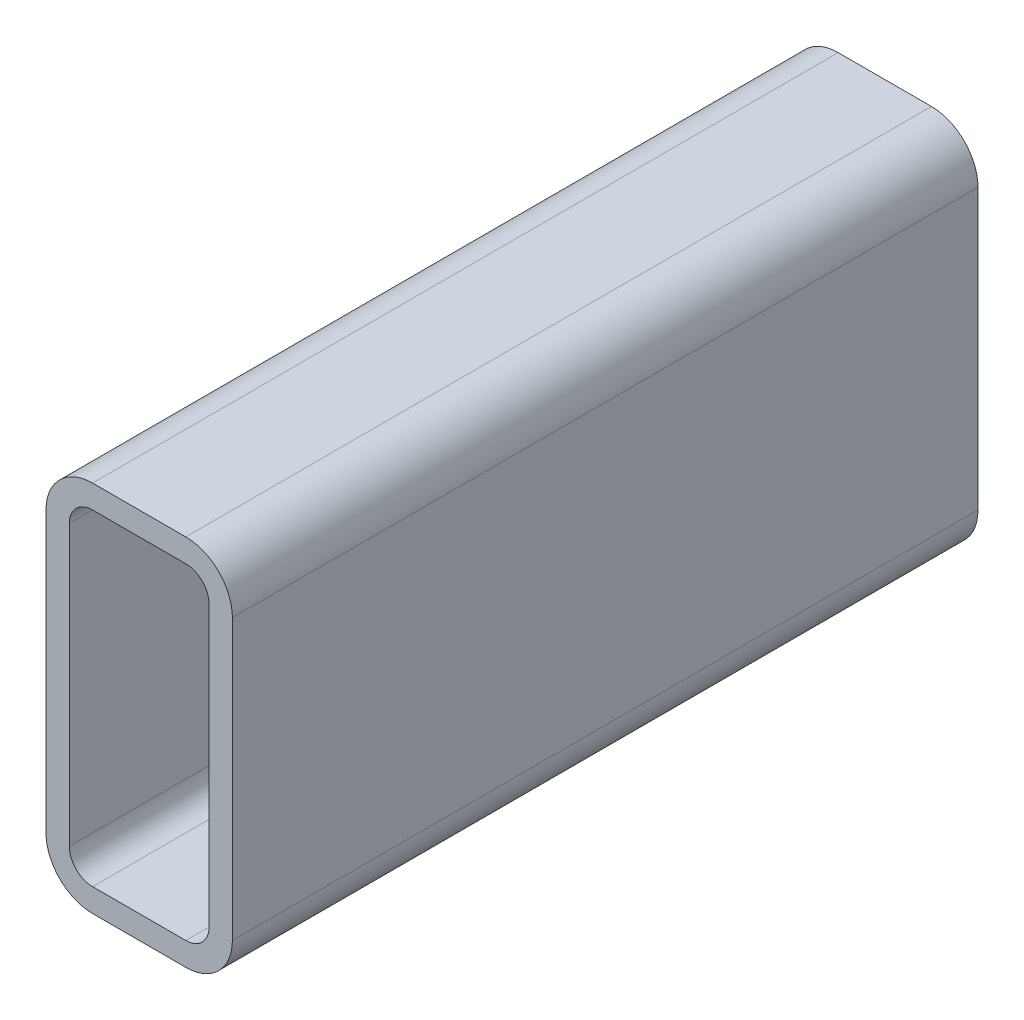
ISO-10303-21;
HEADER;
FILE_DESCRIPTION(('STEP AP214'),'2;1');
FILE_NAME('part.step','',(''),(''),'','','');
FILE_SCHEMA(('AUTOMOTIVE_DESIGN { 1 0 10303 214 1 1 1 1 }'));
ENDSEC;
DATA;
#1=APPLICATION_CONTEXT('core data for automotive mechanical design processes');
#2=APPLICATION_PROTOCOL_DEFINITION('international standard','automotive_design',2000,#1);
#3=PRODUCT_CONTEXT('',#1,'mechanical');
#4=PRODUCT('Part','Part','',(#3));
#5=PRODUCT_RELATED_PRODUCT_CATEGORY('part','',(#4));
#6=PRODUCT_DEFINITION_FORMATION('','',#4);
#7=PRODUCT_DEFINITION_CONTEXT('part definition',#1,'design');
#8=PRODUCT_DEFINITION('design','',#6,#7);
#9=PRODUCT_DEFINITION_SHAPE('','',#8);
#10=(LENGTH_UNIT() NAMED_UNIT(*) SI_UNIT(.MILLI.,.METRE.));
#11=(NAMED_UNIT(*) PLANE_ANGLE_UNIT() SI_UNIT($,.RADIAN.));
#12=(NAMED_UNIT(*) SI_UNIT($,.STERADIAN.) SOLID_ANGLE_UNIT());
#13=UNCERTAINTY_MEASURE_WITH_UNIT(LENGTH_MEASURE(1.E-05),#10,'distance_accuracy_value','');
#14=(GEOMETRIC_REPRESENTATION_CONTEXT(3) GLOBAL_UNCERTAINTY_ASSIGNED_CONTEXT((#13)) GLOBAL_UNIT_ASSIGNED_CONTEXT((#10,
#11,#12)) REPRESENTATION_CONTEXT('',''));
#15=CARTESIAN_POINT('',(0.,0.,0.));
#16=DIRECTION('',(0.,0.,1.));
#17=DIRECTION('',(1.,0.,0.));
#18=AXIS2_PLACEMENT_3D('',#15,#16,#17);
#19=CARTESIAN_POINT('',(21.5391160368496,135.361948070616,304.8));
#20=DIRECTION('',(0.,0.,1.));
#21=DIRECTION('',(1.,0.,0.));
#22=AXIS2_PLACEMENT_3D('',#19,#20,#21);
#23=PLANE('',#22);
#24=CARTESIAN_POINT('',(21.5391160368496,135.361948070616,304.8));
#25=DIRECTION('',(0.,0.,1.));
#26=DIRECTION('',(1.,0.,0.));
#27=AXIS2_PLACEMENT_3D('',#24,#25,#26);
#28=CIRCLE('',#27,19.05);
#29=CARTESIAN_POINT('',(21.5391160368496,154.411948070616,304.8));
#30=VERTEX_POINT('',#29);
#31=CARTESIAN_POINT('',(2.48911603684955,135.361948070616,304.8));
#32=VERTEX_POINT('',#31);
#33=EDGE_CURVE('E211',#30,#32,#28,.T.);
#34=ORIENTED_EDGE('',*,*,#33,.T.);
#35=DIRECTION('',(0.,-1.,0.));
#36=VECTOR('',#35,1.);
#37=CARTESIAN_POINT('',(2.48911603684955,21.0619480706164,304.8));
#38=LINE('',#37,#36);
#39=CARTESIAN_POINT('',(2.48911603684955,21.0619480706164,304.8));
#40=VERTEX_POINT('',#39);
#41=EDGE_CURVE('E214',#32,#40,#38,.T.);
#42=ORIENTED_EDGE('',*,*,#41,.T.);
#43=CARTESIAN_POINT('',(21.5391160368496,21.0619480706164,304.8));
#44=DIRECTION('',(0.,0.,1.));
#45=DIRECTION('',(1.,0.,0.));
#46=AXIS2_PLACEMENT_3D('',#43,#44,#45);
#47=CIRCLE('',#46,19.05);
#48=CARTESIAN_POINT('',(21.5391160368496,2.01194807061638,304.8));
#49=VERTEX_POINT('',#48);
#50=EDGE_CURVE('E217',#40,#49,#47,.T.);
#51=ORIENTED_EDGE('',*,*,#50,.T.);
#52=DIRECTION('',(1.,0.,0.));
#53=VECTOR('',#52,1.);
#54=CARTESIAN_POINT('',(59.6391160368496,2.01194807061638,304.8));
#55=LINE('',#54,#53);
#56=CARTESIAN_POINT('',(59.6391160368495,2.01194807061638,304.8));
#57=VERTEX_POINT('',#56);
#58=EDGE_CURVE('E219',#49,#57,#55,.T.);
#59=ORIENTED_EDGE('',*,*,#58,.T.);
#60=CARTESIAN_POINT('',(59.6391160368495,21.0619480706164,304.8));
#61=DIRECTION('',(0.,0.,1.));
#62=DIRECTION('',(1.,0.,0.));
#63=AXIS2_PLACEMENT_3D('',#60,#61,#62);
#64=CIRCLE('',#63,19.05);
#65=CARTESIAN_POINT('',(78.6891160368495,21.0619480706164,304.8));
#66=VERTEX_POINT('',#65);
#67=EDGE_CURVE('E221',#57,#66,#64,.T.);
#68=ORIENTED_EDGE('',*,*,#67,.T.);
#69=DIRECTION('',(0.,1.,0.));
#70=VECTOR('',#69,1.);
#71=CARTESIAN_POINT('',(78.6891160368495,135.361948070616,304.8));
#72=LINE('',#71,#70);
#73=CARTESIAN_POINT('',(78.6891160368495,135.361948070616,304.8));
#74=VERTEX_POINT('',#73);
#75=EDGE_CURVE('E223',#66,#74,#72,.T.);
#76=ORIENTED_EDGE('',*,*,#75,.T.);
#77=CARTESIAN_POINT('',(59.6391160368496,135.361948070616,304.8));
#78=DIRECTION('',(0.,0.,1.));
#79=DIRECTION('',(1.,0.,0.));
#80=AXIS2_PLACEMENT_3D('',#77,#78,#79);
#81=CIRCLE('',#80,19.05);
#82=CARTESIAN_POINT('',(59.6391160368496,154.411948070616,304.8));
#83=VERTEX_POINT('',#82);
#84=EDGE_CURVE('E225',#74,#83,#81,.T.);
#85=ORIENTED_EDGE('',*,*,#84,.T.);
#86=DIRECTION('',(-1.,0.,0.));
#87=VECTOR('',#86,1.);
#88=CARTESIAN_POINT('',(21.5391160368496,154.411948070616,304.8));
#89=LINE('',#88,#87);
#90=EDGE_CURVE('E227',#83,#30,#89,.T.);
#91=ORIENTED_EDGE('',*,*,#90,.T.);
#92=EDGE_LOOP('',(#34,#42,#51,#59,#68,#76,#85,#91));
#93=FACE_BOUND('',#92,.T.);
#94=DIRECTION('',(0.,-1.,0.));
#95=VECTOR('',#94,1.);
#96=CARTESIAN_POINT('',(12.0141160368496,21.0619480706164,304.8));
#97=LINE('',#96,#95);
#98=CARTESIAN_POINT('',(12.0141160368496,135.361948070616,304.8));
#99=VERTEX_POINT('',#98);
#100=CARTESIAN_POINT('',(12.0141160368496,21.0619480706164,304.8));
#101=VERTEX_POINT('',#100);
#102=EDGE_CURVE('E154',#99,#101,#97,.T.);
#103=ORIENTED_EDGE('',*,*,#102,.F.);
#104=CARTESIAN_POINT('',(21.5391160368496,135.361948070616,304.8));
#105=DIRECTION('',(0.,0.,1.));
#106=DIRECTION('',(1.,0.,0.));
#107=AXIS2_PLACEMENT_3D('',#104,#105,#106);
#108=CIRCLE('',#107,9.52499999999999);
#109=CARTESIAN_POINT('',(21.5391160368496,144.886948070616,304.8));
#110=VERTEX_POINT('',#109);
#111=EDGE_CURVE('E146',#110,#99,#108,.T.);
#112=ORIENTED_EDGE('',*,*,#111,.F.);
#113=DIRECTION('',(-1.,0.,0.));
#114=VECTOR('',#113,1.);
#115=CARTESIAN_POINT('',(21.5391160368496,144.886948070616,304.8));
#116=LINE('',#115,#114);
#117=CARTESIAN_POINT('',(59.6391160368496,144.886948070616,304.8));
#118=VERTEX_POINT('',#117);
#119=EDGE_CURVE('E179',#118,#110,#116,.T.);
#120=ORIENTED_EDGE('',*,*,#119,.F.);
#121=CARTESIAN_POINT('',(59.6391160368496,135.361948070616,304.8));
#122=DIRECTION('',(0.,0.,1.));
#123=DIRECTION('',(1.,0.,0.));
#124=AXIS2_PLACEMENT_3D('',#121,#122,#123);
#125=CIRCLE('',#124,9.52499999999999);
#126=CARTESIAN_POINT('',(69.1641160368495,135.361948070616,304.8));
#127=VERTEX_POINT('',#126);
#128=EDGE_CURVE('E177',#127,#118,#125,.T.);
#129=ORIENTED_EDGE('',*,*,#128,.F.);
#130=DIRECTION('',(0.,1.,0.));
#131=VECTOR('',#130,1.);
#132=CARTESIAN_POINT('',(69.1641160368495,135.361948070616,304.8));
#133=LINE('',#132,#131);
#134=CARTESIAN_POINT('',(69.1641160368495,21.0619480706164,304.8));
#135=VERTEX_POINT('',#134);
#136=EDGE_CURVE('E175',#135,#127,#133,.T.);
#137=ORIENTED_EDGE('',*,*,#136,.F.);
#138=CARTESIAN_POINT('',(59.6391160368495,21.0619480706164,304.8));
#139=DIRECTION('',(0.,0.,1.));
#140=DIRECTION('',(1.,0.,0.));
#141=AXIS2_PLACEMENT_3D('',#138,#139,#140);
#142=CIRCLE('',#141,9.525);
#143=CARTESIAN_POINT('',(59.6391160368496,11.5369480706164,304.8));
#144=VERTEX_POINT('',#143);
#145=EDGE_CURVE('E173',#144,#135,#142,.T.);
#146=ORIENTED_EDGE('',*,*,#145,.F.);
#147=DIRECTION('',(1.,0.,0.));
#148=VECTOR('',#147,1.);
#149=CARTESIAN_POINT('',(59.6391160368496,11.5369480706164,304.8));
#150=LINE('',#149,#148);
#151=CARTESIAN_POINT('',(21.5391160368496,11.5369480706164,304.8));
#152=VERTEX_POINT('',#151);
#153=EDGE_CURVE('E169',#152,#144,#150,.T.);
#154=ORIENTED_EDGE('',*,*,#153,.F.);
#155=CARTESIAN_POINT('',(21.5391160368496,21.0619480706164,304.8));
#156=DIRECTION('',(0.,0.,1.));
#157=DIRECTION('',(1.,0.,0.));
#158=AXIS2_PLACEMENT_3D('',#155,#156,#157);
#159=CIRCLE('',#158,9.525);
#160=EDGE_CURVE('E167',#101,#152,#159,.T.);
#161=ORIENTED_EDGE('',*,*,#160,.F.);
#162=EDGE_LOOP('',(#103,#112,#120,#129,#137,#146,#154,#161));
#163=FACE_BOUND('',#162,.T.);
#164=ADVANCED_FACE('F33',(#93,#163),#23,.T.);
#165=CARTESIAN_POINT('',(21.5391160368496,135.361948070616,0.));
#166=DIRECTION('',(0.,0.,1.));
#167=DIRECTION('',(1.,0.,0.));
#168=AXIS2_PLACEMENT_3D('',#165,#166,#167);
#169=PLANE('',#168);
#170=CARTESIAN_POINT('',(21.5391160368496,135.361948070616,0.));
#171=DIRECTION('',(0.,0.,1.));
#172=DIRECTION('',(1.,0.,0.));
#173=AXIS2_PLACEMENT_3D('',#170,#171,#172);
#174=CIRCLE('',#173,19.05);
#175=CARTESIAN_POINT('',(21.5391160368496,154.411948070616,0.));
#176=VERTEX_POINT('',#175);
#177=CARTESIAN_POINT('',(2.48911603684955,135.361948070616,0.));
#178=VERTEX_POINT('',#177);
#179=EDGE_CURVE('E162',#176,#178,#174,.T.);
#180=ORIENTED_EDGE('',*,*,#179,.F.);
#181=DIRECTION('',(-1.,0.,0.));
#182=VECTOR('',#181,1.);
#183=CARTESIAN_POINT('',(21.5391160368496,154.411948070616,0.));
#184=LINE('',#183,#182);
#185=CARTESIAN_POINT('',(59.6391160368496,154.411948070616,0.));
#186=VERTEX_POINT('',#185);
#187=EDGE_CURVE('E215',#186,#176,#184,.T.);
#188=ORIENTED_EDGE('',*,*,#187,.F.);
#189=CARTESIAN_POINT('',(59.6391160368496,135.361948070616,0.));
#190=DIRECTION('',(0.,0.,1.));
#191=DIRECTION('',(1.,0.,0.));
#192=AXIS2_PLACEMENT_3D('',#189,#190,#191);
#193=CIRCLE('',#192,19.05);
#194=CARTESIAN_POINT('',(78.6891160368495,135.361948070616,0.));
#195=VERTEX_POINT('',#194);
#196=EDGE_CURVE('E242',#195,#186,#193,.T.);
#197=ORIENTED_EDGE('',*,*,#196,.F.);
#198=DIRECTION('',(0.,1.,0.));
#199=VECTOR('',#198,1.);
#200=CARTESIAN_POINT('',(78.6891160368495,135.361948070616,0.));
#201=LINE('',#200,#199);
#202=CARTESIAN_POINT('',(78.6891160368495,21.0619480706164,0.));
#203=VERTEX_POINT('',#202);
#204=EDGE_CURVE('E240',#203,#195,#201,.T.);
#205=ORIENTED_EDGE('',*,*,#204,.F.);
#206=CARTESIAN_POINT('',(59.6391160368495,21.0619480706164,0.));
#207=DIRECTION('',(0.,0.,1.));
#208=DIRECTION('',(1.,0.,0.));
#209=AXIS2_PLACEMENT_3D('',#206,#207,#208);
#210=CIRCLE('',#209,19.05);
#211=CARTESIAN_POINT('',(59.6391160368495,2.01194807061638,0.));
#212=VERTEX_POINT('',#211);
#213=EDGE_CURVE('E238',#212,#203,#210,.T.);
#214=ORIENTED_EDGE('',*,*,#213,.F.);
#215=DIRECTION('',(1.,0.,0.));
#216=VECTOR('',#215,1.);
#217=CARTESIAN_POINT('',(59.6391160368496,2.01194807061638,0.));
#218=LINE('',#217,#216);
#219=CARTESIAN_POINT('',(21.5391160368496,2.01194807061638,0.));
#220=VERTEX_POINT('',#219);
#221=EDGE_CURVE('E236',#220,#212,#218,.T.);
#222=ORIENTED_EDGE('',*,*,#221,.F.);
#223=CARTESIAN_POINT('',(21.5391160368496,21.0619480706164,0.));
#224=DIRECTION('',(0.,0.,1.));
#225=DIRECTION('',(1.,0.,0.));
#226=AXIS2_PLACEMENT_3D('',#223,#224,#225);
#227=CIRCLE('',#226,19.05);
#228=CARTESIAN_POINT('',(2.48911603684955,21.0619480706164,0.));
#229=VERTEX_POINT('',#228);
#230=EDGE_CURVE('E234',#229,#220,#227,.T.);
#231=ORIENTED_EDGE('',*,*,#230,.F.);
#232=DIRECTION('',(0.,-1.,0.));
#233=VECTOR('',#232,1.);
#234=CARTESIAN_POINT('',(2.48911603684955,21.0619480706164,0.));
#235=LINE('',#234,#233);
#236=EDGE_CURVE('E232',#178,#229,#235,.T.);
#237=ORIENTED_EDGE('',*,*,#236,.F.);
#238=EDGE_LOOP('',(#180,#188,#197,#205,#214,#222,#231,#237));
#239=FACE_BOUND('',#238,.T.);
#240=CARTESIAN_POINT('',(21.5391160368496,135.361948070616,0.));
#241=DIRECTION('',(0.,0.,1.));
#242=DIRECTION('',(1.,0.,0.));
#243=AXIS2_PLACEMENT_3D('',#240,#241,#242);
#244=CIRCLE('',#243,9.52499999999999);
#245=CARTESIAN_POINT('',(21.5391160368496,144.886948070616,0.));
#246=VERTEX_POINT('',#245);
#247=CARTESIAN_POINT('',(12.0141160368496,135.361948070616,0.));
#248=VERTEX_POINT('',#247);
#249=EDGE_CURVE('E56',#246,#248,#244,.T.);
#250=ORIENTED_EDGE('',*,*,#249,.T.);
#251=DIRECTION('',(0.,-1.,0.));
#252=VECTOR('',#251,1.);
#253=CARTESIAN_POINT('',(12.0141160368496,21.0619480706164,0.));
#254=LINE('',#253,#252);
#255=CARTESIAN_POINT('',(12.0141160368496,21.0619480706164,0.));
#256=VERTEX_POINT('',#255);
#257=EDGE_CURVE('E161',#248,#256,#254,.T.);
#258=ORIENTED_EDGE('',*,*,#257,.T.);
#259=CARTESIAN_POINT('',(21.5391160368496,21.0619480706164,0.));
#260=DIRECTION('',(0.,0.,1.));
#261=DIRECTION('',(1.,0.,0.));
#262=AXIS2_PLACEMENT_3D('',#259,#260,#261);
#263=CIRCLE('',#262,9.525);
#264=CARTESIAN_POINT('',(21.5391160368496,11.5369480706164,0.));
#265=VERTEX_POINT('',#264);
#266=EDGE_CURVE('E183',#256,#265,#263,.T.);
#267=ORIENTED_EDGE('',*,*,#266,.T.);
#268=DIRECTION('',(1.,0.,0.));
#269=VECTOR('',#268,1.);
#270=CARTESIAN_POINT('',(59.6391160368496,11.5369480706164,0.));
#271=LINE('',#270,#269);
#272=CARTESIAN_POINT('',(59.6391160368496,11.5369480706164,0.));
#273=VERTEX_POINT('',#272);
#274=EDGE_CURVE('E186',#265,#273,#271,.T.);
#275=ORIENTED_EDGE('',*,*,#274,.T.);
#276=CARTESIAN_POINT('',(59.6391160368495,21.0619480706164,0.));
#277=DIRECTION('',(0.,0.,1.));
#278=DIRECTION('',(1.,0.,0.));
#279=AXIS2_PLACEMENT_3D('',#276,#277,#278);
#280=CIRCLE('',#279,9.525);
#281=CARTESIAN_POINT('',(69.1641160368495,21.0619480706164,0.));
#282=VERTEX_POINT('',#281);
#283=EDGE_CURVE('E189',#273,#282,#280,.T.);
#284=ORIENTED_EDGE('',*,*,#283,.T.);
#285=DIRECTION('',(0.,1.,0.));
#286=VECTOR('',#285,1.);
#287=CARTESIAN_POINT('',(69.1641160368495,135.361948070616,0.));
#288=LINE('',#287,#286);
#289=CARTESIAN_POINT('',(69.1641160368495,135.361948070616,0.));
#290=VERTEX_POINT('',#289);
#291=EDGE_CURVE('E192',#282,#290,#288,.T.);
#292=ORIENTED_EDGE('',*,*,#291,.T.);
#293=CARTESIAN_POINT('',(59.6391160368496,135.361948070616,0.));
#294=DIRECTION('',(0.,0.,1.));
#295=DIRECTION('',(1.,0.,0.));
#296=AXIS2_PLACEMENT_3D('',#293,#294,#295);
#297=CIRCLE('',#296,9.52499999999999);
#298=CARTESIAN_POINT('',(59.6391160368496,144.886948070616,0.));
#299=VERTEX_POINT('',#298);
#300=EDGE_CURVE('E195',#290,#299,#297,.T.);
#301=ORIENTED_EDGE('',*,*,#300,.T.);
#302=DIRECTION('',(-1.,0.,0.));
#303=VECTOR('',#302,1.);
#304=CARTESIAN_POINT('',(21.5391160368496,144.886948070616,0.));
#305=LINE('',#304,#303);
#306=EDGE_CURVE('E155',#299,#246,#305,.T.);
#307=ORIENTED_EDGE('',*,*,#306,.T.);
#308=EDGE_LOOP('',(#250,#258,#267,#275,#284,#292,#301,#307));
#309=FACE_BOUND('',#308,.T.);
#310=ADVANCED_FACE('F272',(#239,#309),#169,.F.);
#311=CARTESIAN_POINT('',(21.5391160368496,135.361948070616,304.8));
#312=DIRECTION('',(0.,0.,-1.));
#313=DIRECTION('',(-1.,0.,0.));
#314=AXIS2_PLACEMENT_3D('',#311,#312,#313);
#315=CYLINDRICAL_SURFACE('',#314,19.05);
#316=ORIENTED_EDGE('',*,*,#179,.T.);
#317=DIRECTION('',(0.,0.,-1.));
#318=VECTOR('',#317,1.);
#319=CARTESIAN_POINT('',(2.48911603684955,135.361948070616,304.8));
#320=LINE('',#319,#318);
#321=EDGE_CURVE('E11',#32,#178,#320,.T.);
#322=ORIENTED_EDGE('',*,*,#321,.F.);
#323=ORIENTED_EDGE('',*,*,#33,.F.);
#324=DIRECTION('',(0.,0.,-1.));
#325=VECTOR('',#324,1.);
#326=CARTESIAN_POINT('',(21.5391160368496,154.411948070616,304.8));
#327=LINE('',#326,#325);
#328=EDGE_CURVE('E229',#30,#176,#327,.T.);
#329=ORIENTED_EDGE('',*,*,#328,.T.);
#330=EDGE_LOOP('',(#316,#322,#323,#329));
#331=FACE_BOUND('',#330,.T.);
#332=ADVANCED_FACE('F35',(#331),#315,.T.);
#333=CARTESIAN_POINT('',(2.48911603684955,21.0619480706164,304.8));
#334=DIRECTION('',(1.,0.,0.));
#335=DIRECTION('',(0.,0.,-1.));
#336=AXIS2_PLACEMENT_3D('',#333,#334,#335);
#337=PLANE('',#336);
#338=ORIENTED_EDGE('',*,*,#236,.T.);
#339=DIRECTION('',(0.,0.,-1.));
#340=VECTOR('',#339,1.);
#341=CARTESIAN_POINT('',(2.48911603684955,21.0619480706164,304.8));
#342=LINE('',#341,#340);
#343=EDGE_CURVE('E41',#40,#229,#342,.T.);
#344=ORIENTED_EDGE('',*,*,#343,.F.);
#345=ORIENTED_EDGE('',*,*,#41,.F.);
#346=ORIENTED_EDGE('',*,*,#321,.T.);
#347=EDGE_LOOP('',(#338,#344,#345,#346));
#348=FACE_BOUND('',#347,.T.);
#349=ADVANCED_FACE('F289',(#348),#337,.F.);
#350=CARTESIAN_POINT('',(21.5391160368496,21.0619480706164,304.8));
#351=DIRECTION('',(0.,0.,-1.));
#352=DIRECTION('',(-1.,0.,0.));
#353=AXIS2_PLACEMENT_3D('',#350,#351,#352);
#354=CYLINDRICAL_SURFACE('',#353,19.05);
#355=ORIENTED_EDGE('',*,*,#230,.T.);
#356=DIRECTION('',(0.,0.,-1.));
#357=VECTOR('',#356,1.);
#358=CARTESIAN_POINT('',(21.5391160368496,2.01194807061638,304.8));
#359=LINE('',#358,#357);
#360=EDGE_CURVE('E259',#49,#220,#359,.T.);
#361=ORIENTED_EDGE('',*,*,#360,.F.);
#362=ORIENTED_EDGE('',*,*,#50,.F.);
#363=ORIENTED_EDGE('',*,*,#343,.T.);
#364=EDGE_LOOP('',(#355,#361,#362,#363));
#365=FACE_BOUND('',#364,.T.);
#366=ADVANCED_FACE('F266',(#365),#354,.T.);
#367=CARTESIAN_POINT('',(59.6391160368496,2.01194807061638,304.8));
#368=DIRECTION('',(0.,1.,0.));
#369=DIRECTION('',(0.,0.,1.));
#370=AXIS2_PLACEMENT_3D('',#367,#368,#369);
#371=PLANE('',#370);
#372=ORIENTED_EDGE('',*,*,#221,.T.);
#373=DIRECTION('',(0.,0.,-1.));
#374=VECTOR('',#373,1.);
#375=CARTESIAN_POINT('',(59.6391160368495,2.01194807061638,304.8));
#376=LINE('',#375,#374);
#377=EDGE_CURVE('E256',#57,#212,#376,.T.);
#378=ORIENTED_EDGE('',*,*,#377,.F.);
#379=ORIENTED_EDGE('',*,*,#58,.F.);
#380=ORIENTED_EDGE('',*,*,#360,.T.);
#381=EDGE_LOOP('',(#372,#378,#379,#380));
#382=FACE_BOUND('',#381,.T.);
#383=ADVANCED_FACE('F278',(#382),#371,.F.);
#384=CARTESIAN_POINT('',(59.6391160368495,21.0619480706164,304.8));
#385=DIRECTION('',(0.,0.,-1.));
#386=DIRECTION('',(-1.,0.,0.));
#387=AXIS2_PLACEMENT_3D('',#384,#385,#386);
#388=CYLINDRICAL_SURFACE('',#387,19.05);
#389=ORIENTED_EDGE('',*,*,#213,.T.);
#390=DIRECTION('',(0.,0.,-1.));
#391=VECTOR('',#390,1.);
#392=CARTESIAN_POINT('',(78.6891160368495,21.0619480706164,304.8));
#393=LINE('',#392,#391);
#394=EDGE_CURVE('E253',#66,#203,#393,.T.);
#395=ORIENTED_EDGE('',*,*,#394,.F.);
#396=ORIENTED_EDGE('',*,*,#67,.F.);
#397=ORIENTED_EDGE('',*,*,#377,.T.);
#398=EDGE_LOOP('',(#389,#395,#396,#397));
#399=FACE_BOUND('',#398,.T.);
#400=ADVANCED_FACE('F282',(#399),#388,.T.);
#401=CARTESIAN_POINT('',(78.6891160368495,135.361948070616,304.8));
#402=DIRECTION('',(-1.,0.,0.));
#403=DIRECTION('',(0.,0.,1.));
#404=AXIS2_PLACEMENT_3D('',#401,#402,#403);
#405=PLANE('',#404);
#406=ORIENTED_EDGE('',*,*,#204,.T.);
#407=DIRECTION('',(0.,0.,-1.));
#408=VECTOR('',#407,1.);
#409=CARTESIAN_POINT('',(78.6891160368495,135.361948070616,304.8));
#410=LINE('',#409,#408);
#411=EDGE_CURVE('E250',#74,#195,#410,.T.);
#412=ORIENTED_EDGE('',*,*,#411,.F.);
#413=ORIENTED_EDGE('',*,*,#75,.F.);
#414=ORIENTED_EDGE('',*,*,#394,.T.);
#415=EDGE_LOOP('',(#406,#412,#413,#414));
#416=FACE_BOUND('',#415,.T.);
#417=ADVANCED_FACE('F302',(#416),#405,.F.);
#418=CARTESIAN_POINT('',(59.6391160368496,135.361948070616,304.8));
#419=DIRECTION('',(0.,0.,-1.));
#420=DIRECTION('',(-1.,0.,0.));
#421=AXIS2_PLACEMENT_3D('',#418,#419,#420);
#422=CYLINDRICAL_SURFACE('',#421,19.05);
#423=ORIENTED_EDGE('',*,*,#196,.T.);
#424=DIRECTION('',(0.,0.,-1.));
#425=VECTOR('',#424,1.);
#426=CARTESIAN_POINT('',(59.6391160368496,154.411948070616,304.8));
#427=LINE('',#426,#425);
#428=EDGE_CURVE('E247',#83,#186,#427,.T.);
#429=ORIENTED_EDGE('',*,*,#428,.F.);
#430=ORIENTED_EDGE('',*,*,#84,.F.);
#431=ORIENTED_EDGE('',*,*,#411,.T.);
#432=EDGE_LOOP('',(#423,#429,#430,#431));
#433=FACE_BOUND('',#432,.T.);
#434=ADVANCED_FACE('F300',(#433),#422,.T.);
#435=CARTESIAN_POINT('',(21.5391160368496,154.411948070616,304.8));
#436=DIRECTION('',(0.,-1.,0.));
#437=DIRECTION('',(0.,0.,-1.));
#438=AXIS2_PLACEMENT_3D('',#435,#436,#437);
#439=PLANE('',#438);
#440=ORIENTED_EDGE('',*,*,#187,.T.);
#441=ORIENTED_EDGE('',*,*,#328,.F.);
#442=ORIENTED_EDGE('',*,*,#90,.F.);
#443=ORIENTED_EDGE('',*,*,#428,.T.);
#444=EDGE_LOOP('',(#440,#441,#442,#443));
#445=FACE_BOUND('',#444,.T.);
#446=ADVANCED_FACE('F295',(#445),#439,.F.);
#447=CARTESIAN_POINT('',(21.5391160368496,135.361948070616,304.8));
#448=DIRECTION('',(0.,0.,-1.));
#449=DIRECTION('',(-1.,0.,0.));
#450=AXIS2_PLACEMENT_3D('',#447,#448,#449);
#451=CYLINDRICAL_SURFACE('',#450,9.52499999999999);
#452=ORIENTED_EDGE('',*,*,#249,.F.);
#453=DIRECTION('',(0.,0.,-1.));
#454=VECTOR('',#453,1.);
#455=CARTESIAN_POINT('',(21.5391160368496,144.886948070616,304.8));
#456=LINE('',#455,#454);
#457=EDGE_CURVE('E150',#110,#246,#456,.T.);
#458=ORIENTED_EDGE('',*,*,#457,.F.);
#459=ORIENTED_EDGE('',*,*,#111,.T.);
#460=DIRECTION('',(0.,0.,-1.));
#461=VECTOR('',#460,1.);
#462=CARTESIAN_POINT('',(12.0141160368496,135.361948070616,304.8));
#463=LINE('',#462,#461);
#464=EDGE_CURVE('E149',#99,#248,#463,.T.);
#465=ORIENTED_EDGE('',*,*,#464,.T.);
#466=EDGE_LOOP('',(#452,#458,#459,#465));
#467=FACE_BOUND('',#466,.T.);
#468=ADVANCED_FACE('F148',(#467),#451,.F.);
#469=CARTESIAN_POINT('',(12.0141160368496,21.0619480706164,304.8));
#470=DIRECTION('',(1.,0.,0.));
#471=DIRECTION('',(0.,0.,-1.));
#472=AXIS2_PLACEMENT_3D('',#469,#470,#471);
#473=PLANE('',#472);
#474=ORIENTED_EDGE('',*,*,#257,.F.);
#475=ORIENTED_EDGE('',*,*,#464,.F.);
#476=ORIENTED_EDGE('',*,*,#102,.T.);
#477=DIRECTION('',(0.,0.,-1.));
#478=VECTOR('',#477,1.);
#479=CARTESIAN_POINT('',(12.0141160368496,21.0619480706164,304.8));
#480=LINE('',#479,#478);
#481=EDGE_CURVE('E163',#101,#256,#480,.T.);
#482=ORIENTED_EDGE('',*,*,#481,.T.);
#483=EDGE_LOOP('',(#474,#475,#476,#482));
#484=FACE_BOUND('',#483,.T.);
#485=ADVANCED_FACE('F158',(#484),#473,.T.);
#486=CARTESIAN_POINT('',(21.5391160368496,21.0619480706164,304.8));
#487=DIRECTION('',(0.,0.,-1.));
#488=DIRECTION('',(-1.,0.,0.));
#489=AXIS2_PLACEMENT_3D('',#486,#487,#488);
#490=CYLINDRICAL_SURFACE('',#489,9.525);
#491=ORIENTED_EDGE('',*,*,#266,.F.);
#492=ORIENTED_EDGE('',*,*,#481,.F.);
#493=ORIENTED_EDGE('',*,*,#160,.T.);
#494=DIRECTION('',(0.,0.,-1.));
#495=VECTOR('',#494,1.);
#496=CARTESIAN_POINT('',(21.5391160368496,11.5369480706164,304.8));
#497=LINE('',#496,#495);
#498=EDGE_CURVE('E208',#152,#265,#497,.T.);
#499=ORIENTED_EDGE('',*,*,#498,.T.);
#500=EDGE_LOOP('',(#491,#492,#493,#499));
#501=FACE_BOUND('',#500,.T.);
#502=ADVANCED_FACE('F327',(#501),#490,.F.);
#503=CARTESIAN_POINT('',(59.6391160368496,11.5369480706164,304.8));
#504=DIRECTION('',(0.,1.,0.));
#505=DIRECTION('',(0.,0.,1.));
#506=AXIS2_PLACEMENT_3D('',#503,#504,#505);
#507=PLANE('',#506);
#508=ORIENTED_EDGE('',*,*,#274,.F.);
#509=ORIENTED_EDGE('',*,*,#498,.F.);
#510=ORIENTED_EDGE('',*,*,#153,.T.);
#511=DIRECTION('',(0.,0.,-1.));
#512=VECTOR('',#511,1.);
#513=CARTESIAN_POINT('',(59.6391160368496,11.5369480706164,304.8));
#514=LINE('',#513,#512);
#515=EDGE_CURVE('E206',#144,#273,#514,.T.);
#516=ORIENTED_EDGE('',*,*,#515,.T.);
#517=EDGE_LOOP('',(#508,#509,#510,#516));
#518=FACE_BOUND('',#517,.T.);
#519=ADVANCED_FACE('F331',(#518),#507,.T.);
#520=CARTESIAN_POINT('',(59.6391160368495,21.0619480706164,304.8));
#521=DIRECTION('',(0.,0.,-1.));
#522=DIRECTION('',(-1.,0.,0.));
#523=AXIS2_PLACEMENT_3D('',#520,#521,#522);
#524=CYLINDRICAL_SURFACE('',#523,9.525);
#525=ORIENTED_EDGE('',*,*,#283,.F.);
#526=ORIENTED_EDGE('',*,*,#515,.F.);
#527=ORIENTED_EDGE('',*,*,#145,.T.);
#528=DIRECTION('',(0.,0.,-1.));
#529=VECTOR('',#528,1.);
#530=CARTESIAN_POINT('',(69.1641160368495,21.0619480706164,304.8));
#531=LINE('',#530,#529);
#532=EDGE_CURVE('E204',#135,#282,#531,.T.);
#533=ORIENTED_EDGE('',*,*,#532,.T.);
#534=EDGE_LOOP('',(#525,#526,#527,#533));
#535=FACE_BOUND('',#534,.T.);
#536=ADVANCED_FACE('F337',(#535),#524,.F.);
#537=CARTESIAN_POINT('',(69.1641160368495,135.361948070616,304.8));
#538=DIRECTION('',(-1.,0.,0.));
#539=DIRECTION('',(0.,0.,1.));
#540=AXIS2_PLACEMENT_3D('',#537,#538,#539);
#541=PLANE('',#540);
#542=ORIENTED_EDGE('',*,*,#291,.F.);
#543=ORIENTED_EDGE('',*,*,#532,.F.);
#544=ORIENTED_EDGE('',*,*,#136,.T.);
#545=DIRECTION('',(0.,0.,-1.));
#546=VECTOR('',#545,1.);
#547=CARTESIAN_POINT('',(69.1641160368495,135.361948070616,304.8));
#548=LINE('',#547,#546);
#549=EDGE_CURVE('E202',#127,#290,#548,.T.);
#550=ORIENTED_EDGE('',*,*,#549,.T.);
#551=EDGE_LOOP('',(#542,#543,#544,#550));
#552=FACE_BOUND('',#551,.T.);
#553=ADVANCED_FACE('F341',(#552),#541,.T.);
#554=CARTESIAN_POINT('',(59.6391160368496,135.361948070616,304.8));
#555=DIRECTION('',(0.,0.,-1.));
#556=DIRECTION('',(-1.,0.,0.));
#557=AXIS2_PLACEMENT_3D('',#554,#555,#556);
#558=CYLINDRICAL_SURFACE('',#557,9.52499999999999);
#559=ORIENTED_EDGE('',*,*,#300,.F.);
#560=ORIENTED_EDGE('',*,*,#549,.F.);
#561=ORIENTED_EDGE('',*,*,#128,.T.);
#562=DIRECTION('',(0.,0.,-1.));
#563=VECTOR('',#562,1.);
#564=CARTESIAN_POINT('',(59.6391160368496,144.886948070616,304.8));
#565=LINE('',#564,#563);
#566=EDGE_CURVE('E48',#118,#299,#565,.T.);
#567=ORIENTED_EDGE('',*,*,#566,.T.);
#568=EDGE_LOOP('',(#559,#560,#561,#567));
#569=FACE_BOUND('',#568,.T.);
#570=ADVANCED_FACE('F345',(#569),#558,.F.);
#571=CARTESIAN_POINT('',(21.5391160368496,144.886948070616,304.8));
#572=DIRECTION('',(0.,-1.,0.));
#573=DIRECTION('',(0.,0.,-1.));
#574=AXIS2_PLACEMENT_3D('',#571,#572,#573);
#575=PLANE('',#574);
#576=ORIENTED_EDGE('',*,*,#306,.F.);
#577=ORIENTED_EDGE('',*,*,#566,.F.);
#578=ORIENTED_EDGE('',*,*,#119,.T.);
#579=ORIENTED_EDGE('',*,*,#457,.T.);
#580=EDGE_LOOP('',(#576,#577,#578,#579));
#581=FACE_BOUND('',#580,.T.);
#582=ADVANCED_FACE('F349',(#581),#575,.T.);
#583=CLOSED_SHELL('',(#164,#310,#332,#349,#366,#383,#400,#417,#434,#446,#468,#485,#502,#519,
#536,#553,#570,#582));
#584=MANIFOLD_SOLID_BREP('B2',#583);
#585=ADVANCED_BREP_SHAPE_REPRESENTATION('',(#18,#584),#14);
#586=SHAPE_DEFINITION_REPRESENTATION(#9,#585);
ENDSEC;
END-ISO-10303-21;
